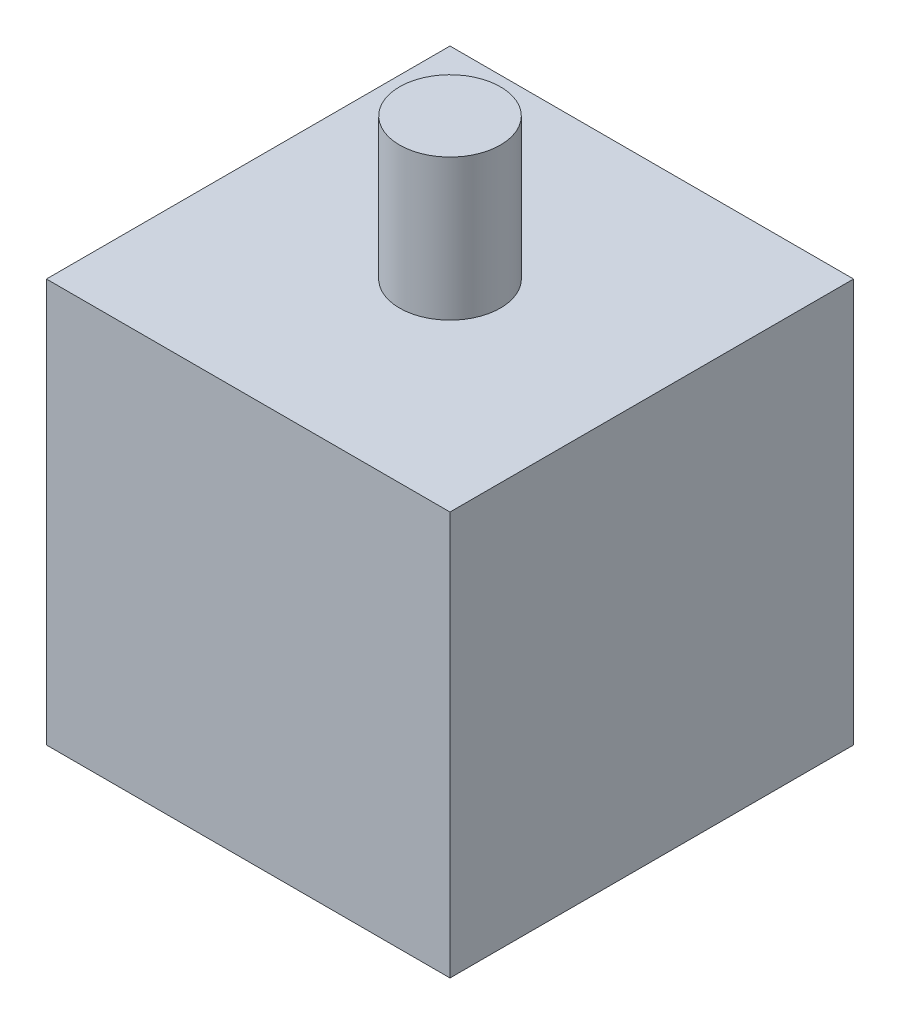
ISO-10303-21;
HEADER;
FILE_DESCRIPTION(('STEP AP214'),'2;1');
FILE_NAME('part.step','',(''),(''),'','','');
FILE_SCHEMA(('AUTOMOTIVE_DESIGN { 1 0 10303 214 1 1 1 1 }'));
ENDSEC;
DATA;
#1=APPLICATION_CONTEXT('core data for automotive mechanical design processes');
#2=APPLICATION_PROTOCOL_DEFINITION('international standard','automotive_design',2000,#1);
#3=PRODUCT_CONTEXT('',#1,'mechanical');
#4=PRODUCT('Part','Part','',(#3));
#5=PRODUCT_RELATED_PRODUCT_CATEGORY('part','',(#4));
#6=PRODUCT_DEFINITION_FORMATION('','',#4);
#7=PRODUCT_DEFINITION_CONTEXT('part definition',#1,'design');
#8=PRODUCT_DEFINITION('design','',#6,#7);
#9=PRODUCT_DEFINITION_SHAPE('','',#8);
#10=(LENGTH_UNIT() NAMED_UNIT(*) SI_UNIT(.MILLI.,.METRE.));
#11=(NAMED_UNIT(*) PLANE_ANGLE_UNIT() SI_UNIT($,.RADIAN.));
#12=(NAMED_UNIT(*) SI_UNIT($,.STERADIAN.) SOLID_ANGLE_UNIT());
#13=UNCERTAINTY_MEASURE_WITH_UNIT(LENGTH_MEASURE(1.E-05),#10,'distance_accuracy_value','');
#14=(GEOMETRIC_REPRESENTATION_CONTEXT(3) GLOBAL_UNCERTAINTY_ASSIGNED_CONTEXT((#13)) GLOBAL_UNIT_ASSIGNED_CONTEXT((#10,
#11,#12)) REPRESENTATION_CONTEXT('',''));
#15=CARTESIAN_POINT('',(0.,0.,0.));
#16=DIRECTION('',(0.,0.,1.));
#17=DIRECTION('',(1.,0.,0.));
#18=AXIS2_PLACEMENT_3D('',#15,#16,#17);
#19=CARTESIAN_POINT('',(0.,20.,0.));
#20=DIRECTION('',(1.,0.,0.));
#21=DIRECTION('',(0.,0.,-1.));
#22=AXIS2_PLACEMENT_3D('',#19,#20,#21);
#23=PLANE('',#22);
#24=DIRECTION('',(0.,0.,1.));
#25=VECTOR('',#24,1.);
#26=CARTESIAN_POINT('',(0.,0.,0.));
#27=LINE('',#26,#25);
#28=CARTESIAN_POINT('',(0.,0.,-20.));
#29=VERTEX_POINT('',#28);
#30=CARTESIAN_POINT('',(0.,0.,0.));
#31=VERTEX_POINT('',#30);
#32=EDGE_CURVE('E99',#29,#31,#27,.T.);
#33=ORIENTED_EDGE('',*,*,#32,.T.);
#34=DIRECTION('',(0.,-1.,0.));
#35=VECTOR('',#34,1.);
#36=CARTESIAN_POINT('',(0.,20.,0.));
#37=LINE('',#36,#35);
#38=CARTESIAN_POINT('',(0.,20.,0.));
#39=VERTEX_POINT('',#38);
#40=EDGE_CURVE('E36',#39,#31,#37,.T.);
#41=ORIENTED_EDGE('',*,*,#40,.F.);
#42=DIRECTION('',(0.,0.,1.));
#43=VECTOR('',#42,1.);
#44=CARTESIAN_POINT('',(0.,20.,0.));
#45=LINE('',#44,#43);
#46=CARTESIAN_POINT('',(0.,20.,-20.));
#47=VERTEX_POINT('',#46);
#48=EDGE_CURVE('E86',#47,#39,#45,.T.);
#49=ORIENTED_EDGE('',*,*,#48,.F.);
#50=DIRECTION('',(0.,-1.,0.));
#51=VECTOR('',#50,1.);
#52=CARTESIAN_POINT('',(0.,20.,-20.));
#53=LINE('',#52,#51);
#54=EDGE_CURVE('E95',#47,#29,#53,.T.);
#55=ORIENTED_EDGE('',*,*,#54,.T.);
#56=EDGE_LOOP('',(#33,#41,#49,#55));
#57=FACE_BOUND('',#56,.T.);
#58=ADVANCED_FACE('F33',(#57),#23,.F.);
#59=CARTESIAN_POINT('',(0.,20.,0.));
#60=DIRECTION('',(0.,0.,-1.));
#61=DIRECTION('',(-1.,0.,0.));
#62=AXIS2_PLACEMENT_3D('',#59,#60,#61);
#63=PLANE('',#62);
#64=DIRECTION('',(1.,0.,0.));
#65=VECTOR('',#64,1.);
#66=CARTESIAN_POINT('',(0.,0.,0.));
#67=LINE('',#66,#65);
#68=CARTESIAN_POINT('',(20.,0.,0.));
#69=VERTEX_POINT('',#68);
#70=EDGE_CURVE('E91',#31,#69,#67,.T.);
#71=ORIENTED_EDGE('',*,*,#70,.T.);
#72=DIRECTION('',(0.,-1.,0.));
#73=VECTOR('',#72,1.);
#74=CARTESIAN_POINT('',(20.,20.,0.));
#75=LINE('',#74,#73);
#76=CARTESIAN_POINT('',(20.,20.,0.));
#77=VERTEX_POINT('',#76);
#78=EDGE_CURVE('E89',#77,#69,#75,.T.);
#79=ORIENTED_EDGE('',*,*,#78,.F.);
#80=DIRECTION('',(1.,0.,0.));
#81=VECTOR('',#80,1.);
#82=CARTESIAN_POINT('',(0.,20.,0.));
#83=LINE('',#82,#81);
#84=EDGE_CURVE('E81',#39,#77,#83,.T.);
#85=ORIENTED_EDGE('',*,*,#84,.F.);
#86=ORIENTED_EDGE('',*,*,#40,.T.);
#87=EDGE_LOOP('',(#71,#79,#85,#86));
#88=FACE_BOUND('',#87,.T.);
#89=ADVANCED_FACE('F90',(#88),#63,.F.);
#90=CARTESIAN_POINT('',(20.,20.,0.));
#91=DIRECTION('',(-1.,0.,0.));
#92=DIRECTION('',(0.,0.,1.));
#93=AXIS2_PLACEMENT_3D('',#90,#91,#92);
#94=PLANE('',#93);
#95=DIRECTION('',(0.,0.,-1.));
#96=VECTOR('',#95,1.);
#97=CARTESIAN_POINT('',(20.,0.,0.));
#98=LINE('',#97,#96);
#99=CARTESIAN_POINT('',(20.,0.,-20.));
#100=VERTEX_POINT('',#99);
#101=EDGE_CURVE('E67',#69,#100,#98,.T.);
#102=ORIENTED_EDGE('',*,*,#101,.T.);
#103=DIRECTION('',(0.,-1.,0.));
#104=VECTOR('',#103,1.);
#105=CARTESIAN_POINT('',(20.,20.,-20.));
#106=LINE('',#105,#104);
#107=CARTESIAN_POINT('',(20.,20.,-20.));
#108=VERTEX_POINT('',#107);
#109=EDGE_CURVE('E92',#108,#100,#106,.T.);
#110=ORIENTED_EDGE('',*,*,#109,.F.);
#111=DIRECTION('',(0.,0.,-1.));
#112=VECTOR('',#111,1.);
#113=CARTESIAN_POINT('',(20.,20.,0.));
#114=LINE('',#113,#112);
#115=EDGE_CURVE('E84',#77,#108,#114,.T.);
#116=ORIENTED_EDGE('',*,*,#115,.F.);
#117=ORIENTED_EDGE('',*,*,#78,.T.);
#118=EDGE_LOOP('',(#102,#110,#116,#117));
#119=FACE_BOUND('',#118,.T.);
#120=ADVANCED_FACE('F93',(#119),#94,.F.);
#121=CARTESIAN_POINT('',(0.,20.,-20.));
#122=DIRECTION('',(0.,0.,1.));
#123=DIRECTION('',(1.,0.,0.));
#124=AXIS2_PLACEMENT_3D('',#121,#122,#123);
#125=PLANE('',#124);
#126=DIRECTION('',(-1.,0.,0.));
#127=VECTOR('',#126,1.);
#128=CARTESIAN_POINT('',(0.,0.,-20.));
#129=LINE('',#128,#127);
#130=EDGE_CURVE('E73',#100,#29,#129,.T.);
#131=ORIENTED_EDGE('',*,*,#130,.T.);
#132=ORIENTED_EDGE('',*,*,#54,.F.);
#133=DIRECTION('',(-1.,0.,0.));
#134=VECTOR('',#133,1.);
#135=CARTESIAN_POINT('',(0.,20.,-20.));
#136=LINE('',#135,#134);
#137=EDGE_CURVE('E50',#108,#47,#136,.T.);
#138=ORIENTED_EDGE('',*,*,#137,.F.);
#139=ORIENTED_EDGE('',*,*,#109,.T.);
#140=EDGE_LOOP('',(#131,#132,#138,#139));
#141=FACE_BOUND('',#140,.T.);
#142=ADVANCED_FACE('F107',(#141),#125,.F.);
#143=CARTESIAN_POINT('',(0.,20.,0.));
#144=DIRECTION('',(0.,-1.,0.));
#145=DIRECTION('',(0.,0.,-1.));
#146=AXIS2_PLACEMENT_3D('',#143,#144,#145);
#147=PLANE('',#146);
#148=CARTESIAN_POINT('',(10.,20.,-10.));
#149=DIRECTION('',(0.,1.,0.));
#150=DIRECTION('',(0.,0.,1.));
#151=AXIS2_PLACEMENT_3D('',#148,#149,#150);
#152=CIRCLE('',#151,2.5);
#153=CARTESIAN_POINT('',(10.,20.,-7.5));
#154=VERTEX_POINT('',#153);
#155=EDGE_CURVE('E11',#154,#154,#152,.T.);
#156=ORIENTED_EDGE('',*,*,#155,.F.);
#157=EDGE_LOOP('',(#156));
#158=FACE_BOUND('',#157,.T.);
#159=ORIENTED_EDGE('',*,*,#48,.T.);
#160=ORIENTED_EDGE('',*,*,#84,.T.);
#161=ORIENTED_EDGE('',*,*,#115,.T.);
#162=ORIENTED_EDGE('',*,*,#137,.T.);
#163=EDGE_LOOP('',(#159,#160,#161,#162));
#164=FACE_BOUND('',#163,.T.);
#165=ADVANCED_FACE('F82',(#158,#164),#147,.F.);
#166=CARTESIAN_POINT('',(0.,0.,0.));
#167=DIRECTION('',(0.,-1.,0.));
#168=DIRECTION('',(0.,0.,-1.));
#169=AXIS2_PLACEMENT_3D('',#166,#167,#168);
#170=PLANE('',#169);
#171=ORIENTED_EDGE('',*,*,#32,.F.);
#172=ORIENTED_EDGE('',*,*,#130,.F.);
#173=ORIENTED_EDGE('',*,*,#101,.F.);
#174=ORIENTED_EDGE('',*,*,#70,.F.);
#175=EDGE_LOOP('',(#171,#172,#173,#174));
#176=FACE_BOUND('',#175,.T.);
#177=ADVANCED_FACE('F110',(#176),#170,.T.);
#178=CARTESIAN_POINT('',(10.,27.,-10.));
#179=DIRECTION('',(0.,-1.,0.));
#180=DIRECTION('',(0.,0.,-1.));
#181=AXIS2_PLACEMENT_3D('',#178,#179,#180);
#182=CYLINDRICAL_SURFACE('',#181,2.5);
#183=CARTESIAN_POINT('',(10.,27.,-10.));
#184=DIRECTION('',(0.,1.,0.));
#185=DIRECTION('',(0.,0.,1.));
#186=AXIS2_PLACEMENT_3D('',#183,#184,#185);
#187=CIRCLE('',#186,2.5);
#188=CARTESIAN_POINT('',(10.,27.,-7.5));
#189=VERTEX_POINT('',#188);
#190=EDGE_CURVE('E102',#189,#189,#187,.T.);
#191=ORIENTED_EDGE('',*,*,#190,.F.);
#192=EDGE_LOOP('',(#191));
#193=FACE_BOUND('',#192,.T.);
#194=ORIENTED_EDGE('',*,*,#155,.T.);
#195=EDGE_LOOP('',(#194));
#196=FACE_BOUND('',#195,.T.);
#197=ADVANCED_FACE('F118',(#193,#196),#182,.T.);
#198=CARTESIAN_POINT('',(10.,27.,-10.));
#199=DIRECTION('',(0.,1.,0.));
#200=DIRECTION('',(0.,0.,1.));
#201=AXIS2_PLACEMENT_3D('',#198,#199,#200);
#202=PLANE('',#201);
#203=ORIENTED_EDGE('',*,*,#190,.T.);
#204=EDGE_LOOP('',(#203));
#205=FACE_BOUND('',#204,.T.);
#206=ADVANCED_FACE('F116',(#205),#202,.T.);
#207=CLOSED_SHELL('',(#58,#89,#120,#142,#165,#177,#197,#206));
#208=MANIFOLD_SOLID_BREP('B2',#207);
#209=ADVANCED_BREP_SHAPE_REPRESENTATION('',(#18,#208),#14);
#210=SHAPE_DEFINITION_REPRESENTATION(#9,#209);
ENDSEC;
END-ISO-10303-21;
